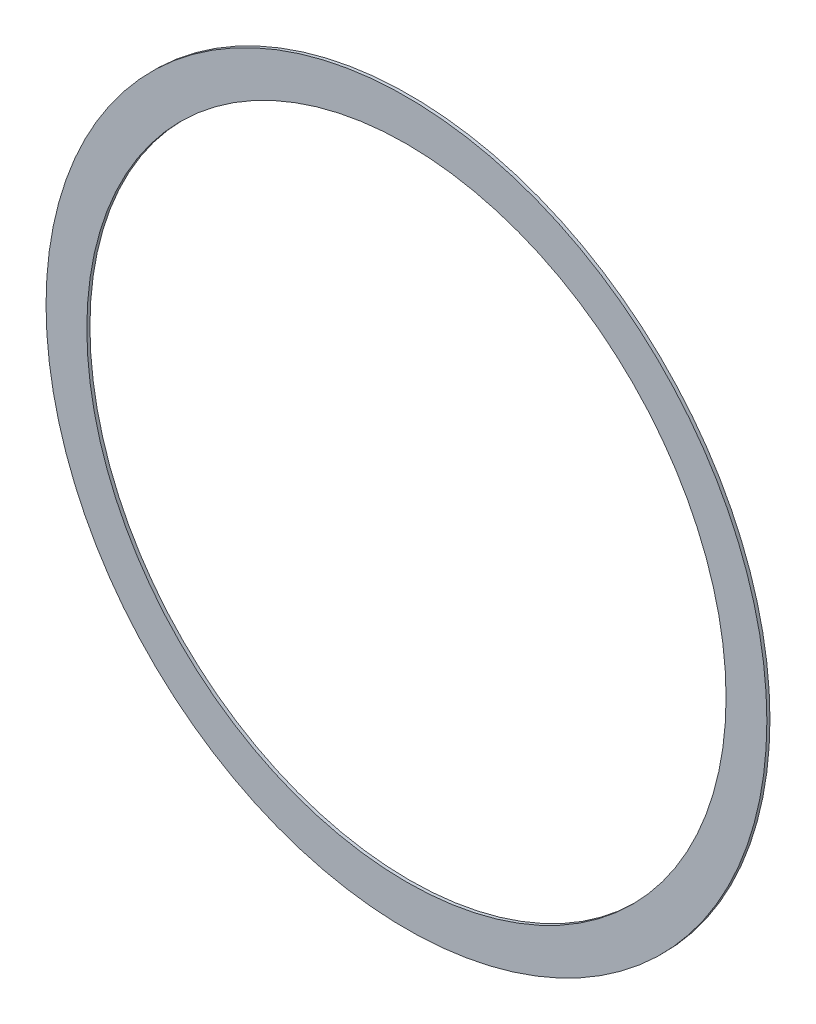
from build123d import *

# Parameters (mm, degrees)
ESQUISSE1_R      = 349
ESQUISSE1_R_2    = 309.5
EXTRUSION1_DEPTH = 3


with BuildPart() as part:
    # Esquisse1 → Extrusion1 (new body)
    with BuildSketch(Plane.XY):
        Circle(ESQUISSE1_R)
        Circle(ESQUISSE1_R_2, mode=Mode.SUBTRACT)
    extrude(amount=EXTRUSION1_DEPTH)


solid = part.part
